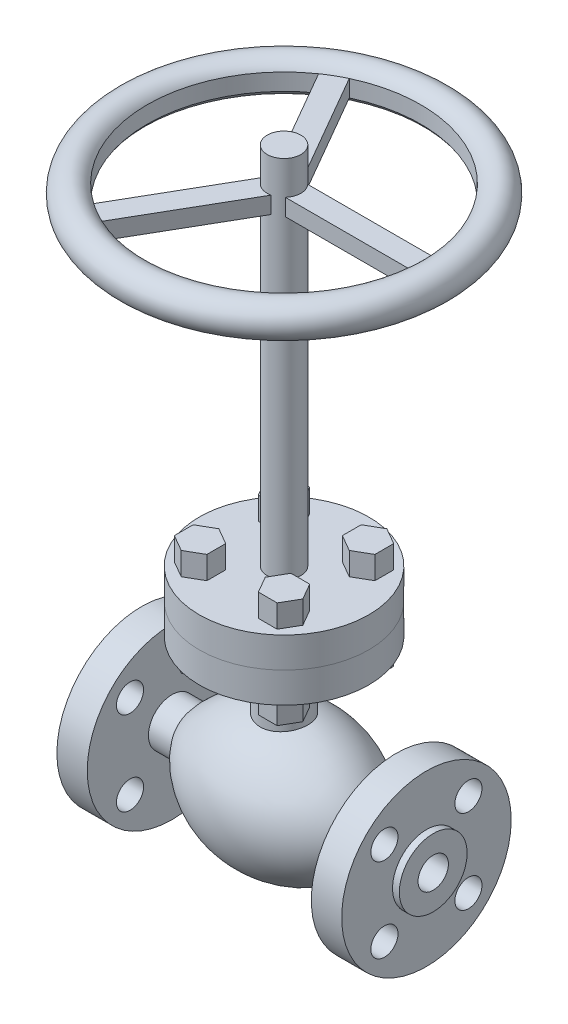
from build123d import *

# Parameters (mm, degrees)
FLOW_FLANGE_SKETCH_R             = 79.375
FLOW_FLANGE_DEPTH                = 34.798
HUB_CUT_SKETCH_OUTSIDE_W         = 232.434
HUB_CUT_SKETCH_OUTSIDE_H         = 232.434
HUB_CUT_SKETCH_OUTSIDE_R         = 31.75
HUB_CUT_DEPTH                    = 6.35
BOLT_HOLE_REACH                  = 303.107
BOLT_HOLE_SKETCH_R               = 12.7
BOLT_HOLE_PATTERN_COUNT          = 4
BOLT_HOLE_PATTERN_ANGLE          = 270
FLANGE_MIRROR_COPY_1_REACH       = 303.107
FLANGE_MIRROR_COPY_1_SKETCH_R    = 12.7
FLANGE_MIRROR_COPY_2_REACH       = 303.107
FLANGE_MIRROR_COPY_2_SKETCH_R    = 12.7
FLANGE_MIRROR_COPY_3_REACH       = 303.107
FLANGE_MIRROR_COPY_3_SKETCH_R    = 12.7
BODY_EXTRUDE_SKETCH_R            = 22.31898
BODY_EXTRUDE_DEPTH               = 122.047
FLANGE_BOTTOM_SKETCH_R           = 79.375
FLANGE_BOTTOM_DEPTH              = 28.448
FLANGE_TOP_SKETCH_R              = 79.375
FLANGE_TOP_DEPTH                 = 28.448
CENTRE_SUPPORT_REACH             = 612.404
CENTRE_SUPPORT_SKETCH_R          = 15.748
CENTRE_SUPPORT_DIRECTION_2_DEPTH = 31.496
DRIVER_START                     = -15.748
DRIVER_CUT_DEPTH                 = 15.748
ID_SKETCH_R                      = 14.224
ID_CUT_DEPTH                     = 620.661150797
BOLT_DEPTH                       = 99.568
BOLT_PATTERN_COUNT               = 4
BOLT_PATTERN_ANGLE               = 270


with BuildPart() as part:
    # Flow Extrude Sketch → Flow Extrude (revolve)
    with BuildSketch(Plane.XY, mode=Mode.PRIVATE) as flow_extrude_sk:
        with BuildLine():
            Line((83.82, 22.098), (139.7, 22.098))
            Line((139.7, 22.098), (139.7, 0))
            Line((139.7, 0), (-139.7, 0))
            Line((-139.7, 0), (-139.7, 22.098))
            Line((-139.7, 22.098), (-83.82, 22.098))
            ThreePointArc((-83.82, 22.098), (0, 63.5), (83.82, 22.098))
        make_face()
    revolve(flow_extrude_sk.sketch.rotate(Axis((-321.740364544, 0, 0), (1, 0, 0)), 90), axis=Axis((-321.740364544, 0, 0), (1, 0, 0)))

    # Flow Flange Sketch → Flow Flange (add)
    with BuildSketch(Plane(origin=(139.7, 0, 0), x_dir=(0, 0, -1), z_dir=(1, 0, 0))):
        Circle(FLOW_FLANGE_SKETCH_R)
    flow_flange = extrude(amount=-FLOW_FLANGE_DEPTH)

    # Hub Cut Sketch outside → Hub Cut (cut)
    with BuildSketch(Plane(origin=(139.7, 0, 0), x_dir=(0, 0, -1), z_dir=(1, 0, 0))):
        Rectangle(HUB_CUT_SKETCH_OUTSIDE_W, HUB_CUT_SKETCH_OUTSIDE_H)
        Circle(HUB_CUT_SKETCH_OUTSIDE_R, mode=Mode.SUBTRACT)
    hub_cut = extrude(amount=-HUB_CUT_DEPTH, mode=Mode.SUBTRACT)

    # Bolt Hole Sketch → Bolt Hole (cut, up to next)
    with BuildSketch(Plane(origin=(139.7, 0, 0), x_dir=(0, 0, -1), z_dir=(1, 0, 0)), mode=Mode.PRIVATE) as bolt_hole_sk1:
        with Locations((39.33352181, 39.33352181)):
            Circle(BOLT_HOLE_SKETCH_R)
    bolt_hole_tool1 = extrude(bolt_hole_sk1.sketch, amount=-BOLT_HOLE_REACH, mode=Mode.PRIVATE) & part.part
    bolt_hole = bolt_hole_tool1.solids().sort_by_distance((139.7, 39.333522, -39.333522))[0]
    add(bolt_hole, mode=Mode.SUBTRACT)

    # Bolt Hole Pattern: Bolt Hole ×4 about axis
    bolt_hole_pattern_axis = Axis((-321.740364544, 0, 0), (1, 0, 0))
    for i in range(1, BOLT_HOLE_PATTERN_COUNT):
        add(bolt_hole.rotate(bolt_hole_pattern_axis, i * BOLT_HOLE_PATTERN_ANGLE / (BOLT_HOLE_PATTERN_COUNT - 1)), mode=Mode.SUBTRACT)

    # Flange Mirror: Flow Flange, Hub Cut, Bolt Hole across plane
    add(flow_flange.mirror(Plane(origin=(0, 0, 0), x_dir=(0, 0, 1), z_dir=(1, 0, 0))))
    add(hub_cut.mirror(Plane(origin=(0, 0, 0), x_dir=(0, 0, 1), z_dir=(1, 0, 0))), mode=Mode.SUBTRACT)
    add(bolt_hole.mirror(Plane(origin=(0, 0, 0), x_dir=(0, 0, 1), z_dir=(1, 0, 0))), mode=Mode.SUBTRACT)

    # Flange Mirror copy 1 sketch → Flange Mirror copy 1 (cut, up to next)
    with BuildSketch(Plane(origin=(-139.7, 0, 0), x_dir=(0, 1, 0), z_dir=(-1, 0, 0)), mode=Mode.PRIVATE) as flange_mirror_copy_1_sk1:
        with Locations((39.33352181, -39.33352181)):
            Circle(FLANGE_MIRROR_COPY_1_SKETCH_R)
    flange_mirror_copy_1_tool1 = extrude(flange_mirror_copy_1_sk1.sketch, amount=-FLANGE_MIRROR_COPY_1_REACH, mode=Mode.PRIVATE) & part.part
    add(flange_mirror_copy_1_tool1.solids().sort_by_distance((-139.7, 39.333522, 39.333522))[0], mode=Mode.SUBTRACT)

    # Flange Mirror copy 2 sketch → Flange Mirror copy 2 (cut, up to next)
    with BuildSketch(Plane.ZY.offset(139.7), mode=Mode.PRIVATE) as flange_mirror_copy_2_sk1:
        with Locations((39.33352181, -39.33352181)):
            Circle(FLANGE_MIRROR_COPY_2_SKETCH_R)
    flange_mirror_copy_2_tool1 = extrude(flange_mirror_copy_2_sk1.sketch, amount=-FLANGE_MIRROR_COPY_2_REACH, mode=Mode.PRIVATE) & part.part
    add(flange_mirror_copy_2_tool1.solids().sort_by_distance((-139.7, -39.333522, 39.333522))[0], mode=Mode.SUBTRACT)

    # Flange Mirror copy 3 sketch → Flange Mirror copy 3 (cut, up to next)
    with BuildSketch(Plane(origin=(-139.7, 0, 0), x_dir=(0, -1, 0), z_dir=(-1, 0, 0)), mode=Mode.PRIVATE) as flange_mirror_copy_3_sk1:
        with Locations((39.33352181, -39.33352181)):
            Circle(FLANGE_MIRROR_COPY_3_SKETCH_R)
    flange_mirror_copy_3_tool1 = extrude(flange_mirror_copy_3_sk1.sketch, amount=-FLANGE_MIRROR_COPY_3_REACH, mode=Mode.PRIVATE) & part.part
    add(flange_mirror_copy_3_tool1.solids().sort_by_distance((-139.7, -39.333522, -39.333522))[0], mode=Mode.SUBTRACT)

    # Body Extrude Sketch → Body Extrude (add)
    with BuildSketch(Plane(origin=(0, 0, 0), x_dir=(1, 0, 0), z_dir=(0, 1, 0))):
        with Locations(Location((0, 0, 0), (0, 0, 134.315683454))):
            Circle(BODY_EXTRUDE_SKETCH_R)
    extrude(amount=BODY_EXTRUDE_DEPTH)

    # Flange Bottom Sketch → Flange Bottom (add)
    with BuildSketch(Plane(origin=(0, 122.047, 0), x_dir=(-1, 0, 0), z_dir=(0, 1, 0))):
        with Locations(Location((0, 0, 0), (0, 0, 90))):
            Circle(FLANGE_BOTTOM_SKETCH_R)
    extrude(amount=FLANGE_BOTTOM_DEPTH)

    # Flange Top Sketch → Flange Top (add)
    with BuildSketch(Plane(origin=(0, 150.495, 0), x_dir=(-1, 0, 0), z_dir=(0, 1, 0))):
        with Locations(Location((0, 0, 0), (0, 0, 90))):
            Circle(FLANGE_TOP_SKETCH_R)
    extrude(amount=FLANGE_TOP_DEPTH)

    # Centre Support: up to this face of the body (flat: up to its plane)
    centre_support_end = Plane(part.part.faces().sort_by_distance((0, 178.943, 0))[0])
    # Centre Support Sketch → Centre Support (add, up to the picked face)
    with BuildSketch(Plane(origin=(0, 488.95, 0), x_dir=(-1, 0, 0), z_dir=(0, 1, 0)), mode=Mode.PRIVATE) as centre_support_sk1:
        with Locations(Location((0, 0, 0), (0, 0, 90))):
            Circle(CENTRE_SUPPORT_SKETCH_R)
    centre_support_tool1 = split(extrude(centre_support_sk1.sketch, amount=-CENTRE_SUPPORT_REACH, mode=Mode.PRIVATE), bisect_by=centre_support_end, keep=Keep.BOTH, mode=Mode.PRIVATE)


with BuildPart() as body_2:
    # Driver Sweep: sweep along a path in Driver Path
    with BuildLine(Plane(origin=(0, 481.076, 0), x_dir=(-1, 0, 0), z_dir=(0, 1, 0))) as driver_sweep_path:
        CenterArc((0, 0), 157.48, 0, 360)
    # Driver Profile → Driver Sweep (sweep)
    with BuildSketch(Plane.XY):
        with BuildLine():
            Line((-128.093831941, 488.95), (0, 488.95))
            Line((0, 488.95), (0, 473.202))
            Line((0, 473.202), (-128.093831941, 473.202))
            ThreePointArc((-128.093831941, 473.202), (-157.48, 481.076), (-128.093831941, 488.95))
        make_face()
    sweep(path=driver_sweep_path.line)


with BuildPart() as part_1:
    add(part.part)

    add(body_2.part)  # Centre Support merges body 2
    add(centre_support_tool1.solids().sort_by(Axis((0, 488.95, 0), (0, -1, 0)))[0])

    # Centre Support Sketch → Centre Support direction 2 (add)
    with BuildSketch(Plane(origin=(0, 488.95, 0), x_dir=(-1, 0, 0), z_dir=(0, 1, 0))):
        with Locations(Location((0, 0, 0), (0, 0, 90))):
            Circle(CENTRE_SUPPORT_SKETCH_R)
    extrude(amount=CENTRE_SUPPORT_DIRECTION_2_DEPTH)

    # Driver Cut Sketch → Driver Cut (cut)
    with BuildSketch(Plane(origin=(0, 488.95, 0), x_dir=(-1, 0, 0), z_dir=(0, 1, 0)).offset(DRIVER_START)):
        with BuildLine():
            Line((54.739321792, 115.808619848), (-3.223178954, 15.414623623))
            ThreePointArc((-3.223178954, 15.414623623), (-7.874, 13.638168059), (-11.73786617, 10.498666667))
            Line((-11.73786617, 10.498666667), (-127.662867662, 10.498666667))
            ThreePointArc((-127.662867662, 10.498666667), (-64.046915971, 110.932512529), (54.739321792, 115.808619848))
        make_face()
        with BuildLine():
            Line((-127.662867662, -10.498666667), (-11.73786617, -10.498666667))
            ThreePointArc((-11.73786617, -10.498666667), (-7.874, -13.638168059), (-3.223178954, -15.414623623))
            Line((-3.223178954, -15.414623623), (54.739321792, -115.808619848))
            ThreePointArc((54.739321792, -115.808619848), (-64.046915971, -110.932512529), (-127.662867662, -10.498666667))
        make_face()
        with BuildLine():
            Line((72.92354587, 105.309953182), (14.961045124, 4.915956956))
            ThreePointArc((14.961045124, 4.915956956), (15.748, 0), (14.961045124, -4.915956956))
            Line((14.961045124, -4.915956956), (72.92354587, -105.309953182))
            ThreePointArc((72.92354587, -105.309953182), (128.093831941, 0), (72.92354587, 105.309953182))
        make_face()
    extrude(amount=DRIVER_CUT_DEPTH, mode=Mode.SUBTRACT)

    # ID Sketch → ID Cut (cut, through all)
    with BuildSketch(Plane.ZY.offset(-139.7)):
        with Locations(Location((0, 0, 0), (0, 0, 180))):
            Circle(ID_SKETCH_R)
    extrude(amount=ID_CUT_DEPTH, mode=Mode.SUBTRACT)

    # Bolt Sketch → Bolt (add)
    with BuildSketch(Plane(origin=(0, 200.279, 0), x_dir=(-1, 0, 0), z_dir=(0, 1, 0))):
        Polygon((-39.33352181, -21.735885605), (-54.57352181, -30.534703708), (-54.57352181, -48.132339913), (-39.33352181, -56.931158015), (-24.09352181, -48.132339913), (-24.09352181, -30.534703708), align=None)
    bolt = extrude(amount=-BOLT_DEPTH)

    # Bolt Pattern: Bolt ×4 about axis
    bolt_pattern_axis = Axis((0, 150.495, 0), (0, -1, 0))
    for i in range(1, BOLT_PATTERN_COUNT):
        add(bolt.rotate(bolt_pattern_axis, i * BOLT_PATTERN_ANGLE / (BOLT_PATTERN_COUNT - 1)))


solid = part_1.part
